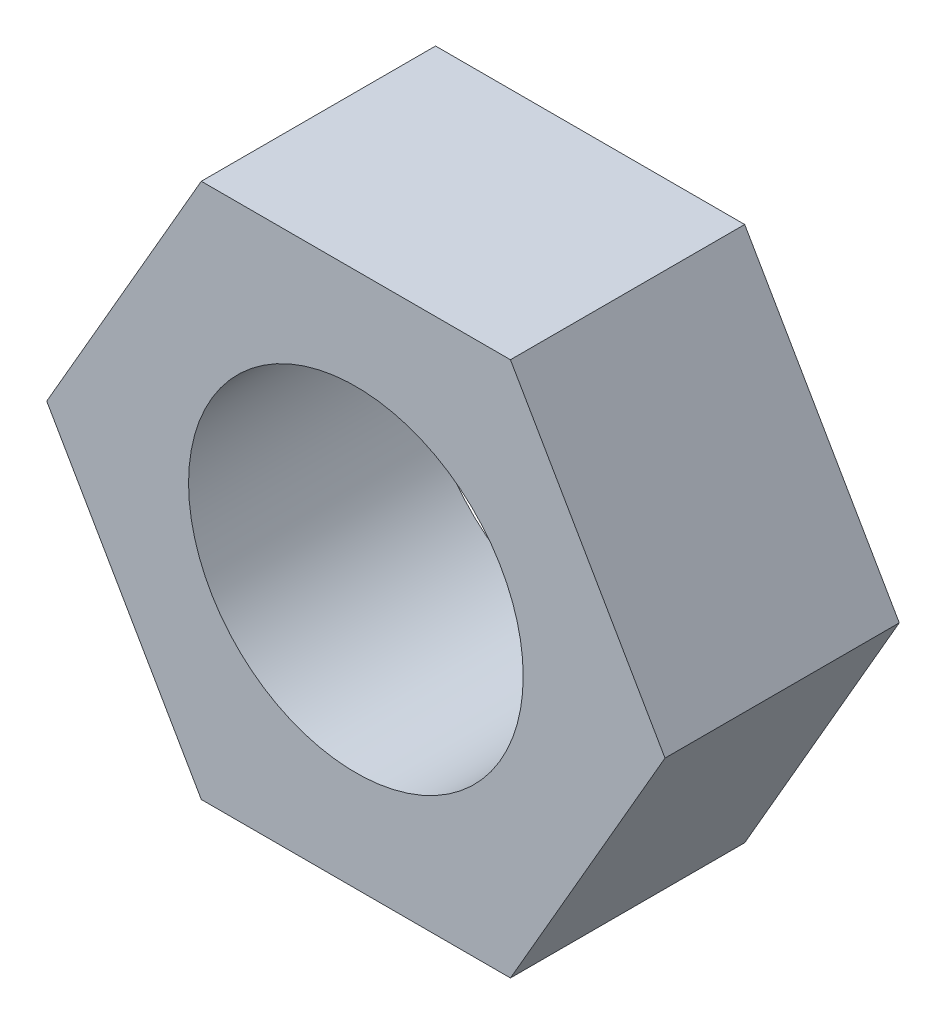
from build123d import *

# Parameters (mm, degrees)
SKETCH_1_R      = 2.5
EXTRUDE_1_DEPTH = 3.5


with BuildPart() as part:
    # Sketch 1 → Extrude 1 (new body)
    with BuildSketch(Plane.XY):
        Polygon((4.618802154, 0), (2.309401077, 4), (-2.309401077, 4), (-4.618802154, 0), (-2.309401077, -4), (2.309401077, -4), align=None)
        Circle(SKETCH_1_R, mode=Mode.SUBTRACT)
    extrude(amount=EXTRUDE_1_DEPTH)


solid = part.part
